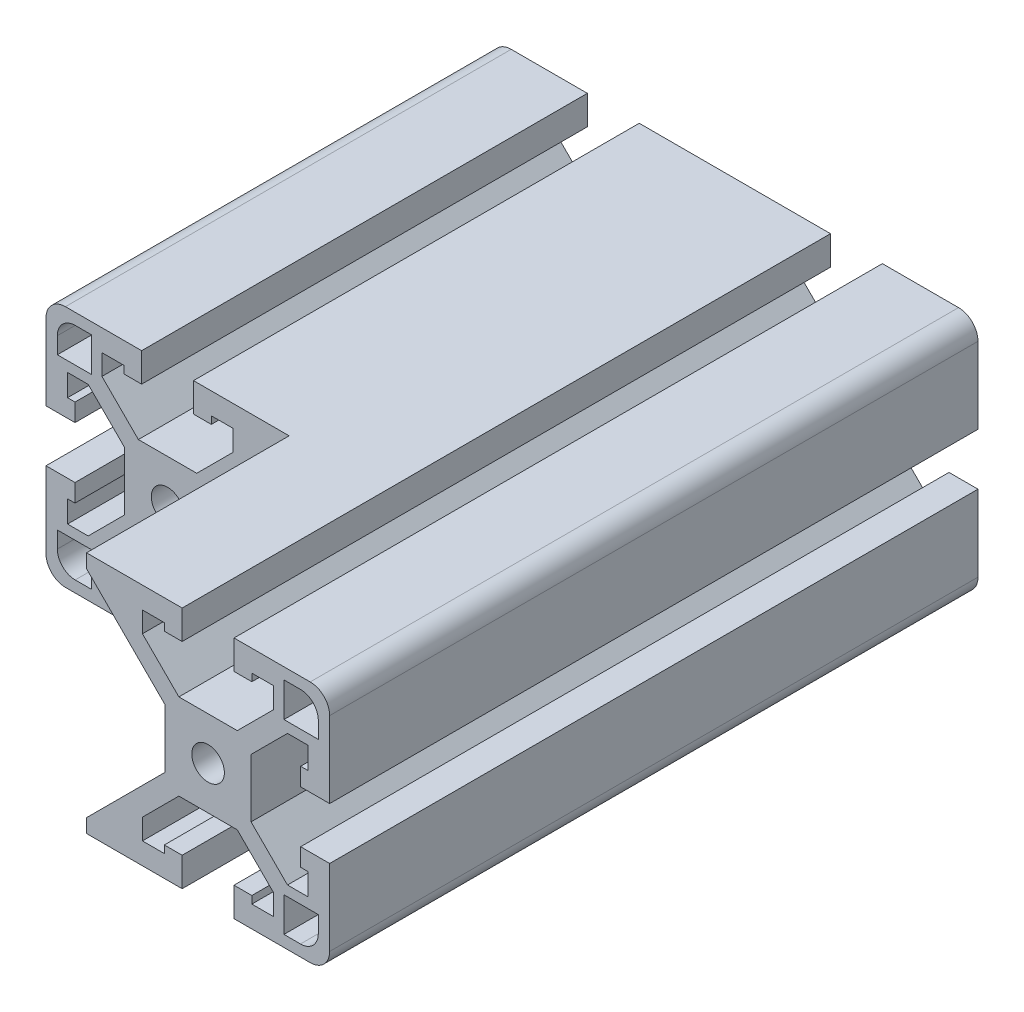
from build123d import *

# Parameters (mm, degrees)
SKETCH1_R           = 2.5527
BOSS_EXTRUDE1_DEPTH = 50.8
SKETCH2_W           = 38.1
SKETCH2_H           = 38.1
CUT_EXTRUDE1_DEPTH  = 31.75


with BuildPart() as part:
    # Sketch1 → Boss-Extrude1 (new, symmetric)
    with BuildSketch(Plane.XY):
        with BuildLine():
            Line((-29.337, 12.442261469), (-29.337, 15.6718))
            Line((-29.337, 15.6718), (-25.908, 15.6718))
            Line((-25.908, 15.6718), (-25.908, 14.5034))
            Line((-25.908, 14.5034), (-23.114, 14.5034))
            Line((-23.114, 14.5034), (-23.114, 19.05))
            Line((-23.114, 19.05), (-35.052, 19.05))
            ThreePointArc((-35.052, 19.05), (-37.207261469, 18.157261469), (-38.1, 16.002))
            Line((-38.1, 16.002), (-38.1, 4.064))
            Line((-38.1, 4.064), (-33.5534, 4.064))
            Line((-33.5534, 4.064), (-33.5534, 6.858))
            Line((-33.5534, 6.858), (-34.7218, 6.858))
            Line((-34.7218, 6.858), (-34.7218, 10.287))
            Line((-34.7218, 10.287), (-31.492261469, 10.287))
            Line((-31.492261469, 10.287), (-25.781, 4.575738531))
            Line((-25.781, 4.575738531), (-25.781, -4.575738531))
            Line((-25.781, -4.575738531), (-31.492261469, -10.287))
            Line((-31.492261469, -10.287), (-34.7218, -10.287))
            Line((-34.7218, -10.287), (-34.7218, -6.858))
            Line((-34.7218, -6.858), (-33.5534, -6.858))
            Line((-33.5534, -6.858), (-33.5534, -4.064))
            Line((-33.5534, -4.064), (-38.1, -4.064))
            Line((-38.1, -4.064), (-38.1, -16.002))
            ThreePointArc((-38.1, -16.002), (-37.207261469, -18.157261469), (-35.052, -19.05))
            Line((-35.052, -19.05), (-23.114, -19.05))
            Line((-23.114, -19.05), (-23.114, -14.5034))
            Line((-23.114, -14.5034), (-25.908, -14.5034))
            Line((-25.908, -14.5034), (-25.908, -15.6718))
            Line((-25.908, -15.6718), (-29.337, -15.6718))
            Line((-29.337, -15.6718), (-29.337, -12.442261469))
            Line((-29.337, -12.442261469), (-23.625738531, -6.731))
            Line((-23.625738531, -6.731), (-14.474261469, -6.731))
            Line((-14.474261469, -6.731), (-8.763, -12.442261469))
            Line((-8.763, -12.442261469), (-8.763, -15.6718))
            Line((-8.763, -15.6718), (-12.192, -15.6718))
            Line((-12.192, -15.6718), (-12.192, -14.5034))
            Line((-12.192, -14.5034), (-14.986, -14.5034))
            Line((-14.986, -14.5034), (-14.986, -19.05))
            Line((-14.986, -19.05), (14.986, -19.05))
            Line((14.986, -19.05), (14.986, -14.5034))
            Line((14.986, -14.5034), (12.192, -14.5034))
            Line((12.192, -14.5034), (12.192, -15.6718))
            Line((12.192, -15.6718), (8.763, -15.6718))
            Line((8.763, -15.6718), (8.763, -12.442261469))
            Line((8.763, -12.442261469), (14.474261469, -6.731))
            Line((14.474261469, -6.731), (23.625738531, -6.731))
            Line((23.625738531, -6.731), (29.337, -12.442261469))
            Line((29.337, -12.442261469), (29.337, -15.6718))
            Line((29.337, -15.6718), (25.908, -15.6718))
            Line((25.908, -15.6718), (25.908, -14.5034))
            Line((25.908, -14.5034), (23.114, -14.5034))
            Line((23.114, -14.5034), (23.114, -19.05))
            Line((23.114, -19.05), (35.052, -19.05))
            ThreePointArc((35.052, -19.05), (37.207261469, -18.157261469), (38.1, -16.002))
            Line((38.1, -16.002), (38.1, -4.064))
            Line((38.1, -4.064), (33.5534, -4.064))
            Line((33.5534, -4.064), (33.5534, -6.858))
            Line((33.5534, -6.858), (34.7218, -6.858))
            Line((34.7218, -6.858), (34.7218, -10.287))
            Line((34.7218, -10.287), (31.492261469, -10.287))
            Line((31.492261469, -10.287), (25.781, -4.575738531))
            Line((25.781, -4.575738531), (25.781, 4.575738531))
            Line((25.781, 4.575738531), (31.492261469, 10.287))
            Line((31.492261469, 10.287), (34.7218, 10.287))
            Line((34.7218, 10.287), (34.7218, 6.858))
            Line((34.7218, 6.858), (33.5534, 6.858))
            Line((33.5534, 6.858), (33.5534, 4.064))
            Line((33.5534, 4.064), (38.1, 4.064))
            Line((38.1, 4.064), (38.1, 16.002))
            ThreePointArc((38.1, 16.002), (37.207261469, 18.157261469), (35.052, 19.05))
            Line((35.052, 19.05), (23.114, 19.05))
            Line((23.114, 19.05), (23.114, 14.5034))
            Line((23.114, 14.5034), (25.908, 14.5034))
            Line((25.908, 14.5034), (25.908, 15.6718))
            Line((25.908, 15.6718), (29.337, 15.6718))
            Line((29.337, 15.6718), (29.337, 12.442261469))
            Line((29.337, 12.442261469), (23.625738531, 6.731))
            Line((23.625738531, 6.731), (14.474261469, 6.731))
            Line((14.474261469, 6.731), (8.763, 12.442261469))
            Line((8.763, 12.442261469), (8.763, 15.6718))
            Line((8.763, 15.6718), (12.192, 15.6718))
            Line((12.192, 15.6718), (12.192, 14.5034))
            Line((12.192, 14.5034), (14.986, 14.5034))
            Line((14.986, 14.5034), (14.986, 19.05))
            Line((14.986, 19.05), (-14.986, 19.05))
            Line((-14.986, 19.05), (-14.986, 14.5034))
            Line((-14.986, 14.5034), (-12.192, 14.5034))
            Line((-12.192, 14.5034), (-12.192, 15.6718))
            Line((-12.192, 15.6718), (-8.763, 15.6718))
            Line((-8.763, 15.6718), (-8.763, 12.442261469))
            Line((-8.763, 12.442261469), (-14.474261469, 6.731))
            Line((-14.474261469, 6.731), (-23.625738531, 6.731))
            Line((-23.625738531, 6.731), (-29.337, 12.442261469))
        make_face()
        with Locations((-19.05, 0)):
            Circle(SKETCH1_R, mode=Mode.SUBTRACT)
        with Locations((19.05, 0)):
            Circle(SKETCH1_R, mode=Mode.SUBTRACT)
        Polygon((-12.319, 4.575738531), (-12.319, -4.575738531), (0, -16.894738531), (12.319, -4.575738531), (12.319, 4.575738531), (0, 16.894738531), align=None, mode=Mode.SUBTRACT)
        with BuildLine():
            Line((-30.9372, 11.8872), (-30.9372, 17.272))
            Line((-30.9372, 17.272), (-33.528, 17.272))
            ThreePointArc((-33.528, 17.272), (-35.503656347, 16.453656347), (-36.322, 14.478))
            Line((-36.322, 14.478), (-36.322, 11.8872))
            Line((-36.322, 11.8872), (-30.9372, 11.8872))
        make_face(mode=Mode.SUBTRACT)
        with BuildLine():
            Line((-30.9372, -17.272), (-30.9372, -11.8872))
            Line((-30.9372, -11.8872), (-36.322, -11.8872))
            Line((-36.322, -11.8872), (-36.322, -14.478))
            ThreePointArc((-36.322, -14.478), (-35.503656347, -16.453656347), (-33.528, -17.272))
            Line((-33.528, -17.272), (-30.9372, -17.272))
        make_face(mode=Mode.SUBTRACT)
        with BuildLine():
            Line((36.322, -11.8872), (30.9372, -11.8872))
            Line((30.9372, -11.8872), (30.9372, -17.272))
            Line((30.9372, -17.272), (33.528, -17.272))
            ThreePointArc((33.528, -17.272), (35.503656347, -16.453656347), (36.322, -14.478))
            Line((36.322, -14.478), (36.322, -11.8872))
        make_face(mode=Mode.SUBTRACT)
        with BuildLine():
            Line((30.9372, 17.272), (30.9372, 11.8872))
            Line((30.9372, 11.8872), (36.322, 11.8872))
            Line((36.322, 11.8872), (36.322, 14.478))
            ThreePointArc((36.322, 14.478), (35.503656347, 16.453656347), (33.528, 17.272))
            Line((33.528, 17.272), (30.9372, 17.272))
        make_face(mode=Mode.SUBTRACT)
    extrude(amount=BOSS_EXTRUDE1_DEPTH, both=True)

    # Sketch2 → Cut-Extrude1 (cut)
    with BuildSketch(Plane.XY.offset(50.8)):
        with Locations((-19.05, 0)):
            Rectangle(SKETCH2_W, SKETCH2_H)
    extrude(amount=-CUT_EXTRUDE1_DEPTH, mode=Mode.SUBTRACT)


solid = part.part
